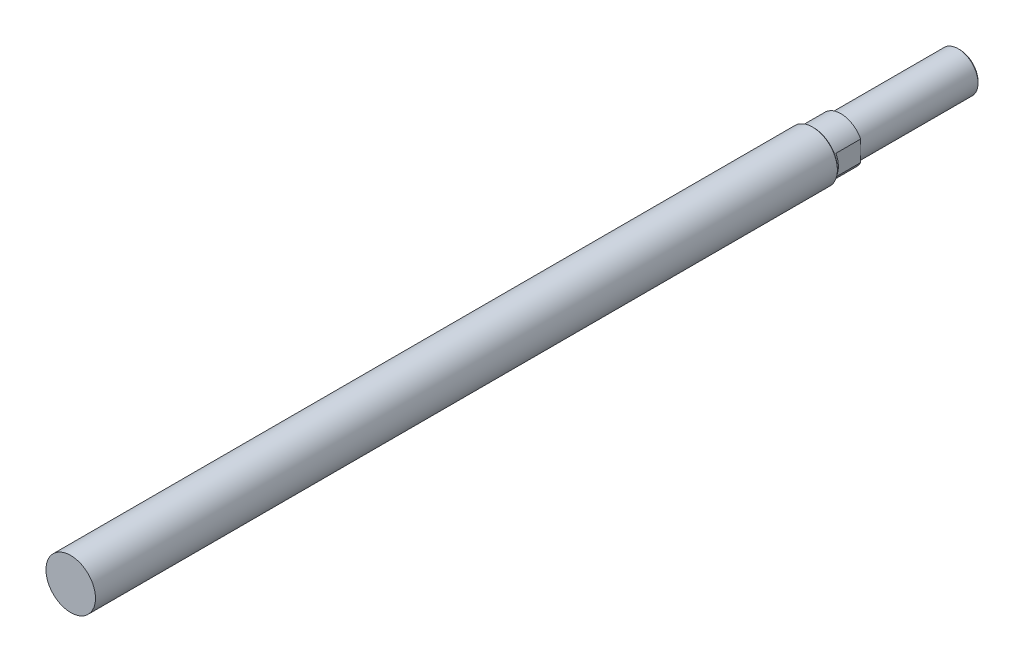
ISO-10303-21;
HEADER;
FILE_DESCRIPTION(('STEP AP214'),'2;1');
FILE_NAME('part.step','',(''),(''),'','','');
FILE_SCHEMA(('AUTOMOTIVE_DESIGN { 1 0 10303 214 1 1 1 1 }'));
ENDSEC;
DATA;
#1=APPLICATION_CONTEXT('core data for automotive mechanical design processes');
#2=APPLICATION_PROTOCOL_DEFINITION('international standard','automotive_design',2000,#1);
#3=PRODUCT_CONTEXT('',#1,'mechanical');
#4=PRODUCT('Part','Part','',(#3));
#5=PRODUCT_RELATED_PRODUCT_CATEGORY('part','',(#4));
#6=PRODUCT_DEFINITION_FORMATION('','',#4);
#7=PRODUCT_DEFINITION_CONTEXT('part definition',#1,'design');
#8=PRODUCT_DEFINITION('design','',#6,#7);
#9=PRODUCT_DEFINITION_SHAPE('','',#8);
#10=(LENGTH_UNIT() NAMED_UNIT(*) SI_UNIT(.MILLI.,.METRE.));
#11=(NAMED_UNIT(*) PLANE_ANGLE_UNIT() SI_UNIT($,.RADIAN.));
#12=(NAMED_UNIT(*) SI_UNIT($,.STERADIAN.) SOLID_ANGLE_UNIT());
#13=UNCERTAINTY_MEASURE_WITH_UNIT(LENGTH_MEASURE(1.E-05),#10,'distance_accuracy_value','');
#14=(GEOMETRIC_REPRESENTATION_CONTEXT(3) GLOBAL_UNCERTAINTY_ASSIGNED_CONTEXT((#13)) GLOBAL_UNIT_ASSIGNED_CONTEXT((#10,
#11,#12)) REPRESENTATION_CONTEXT('',''));
#15=CARTESIAN_POINT('',(0.,0.,0.));
#16=DIRECTION('',(0.,0.,1.));
#17=DIRECTION('',(1.,0.,0.));
#18=AXIS2_PLACEMENT_3D('',#15,#16,#17);
#19=CARTESIAN_POINT('',(0.,0.,-5.50000000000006));
#20=DIRECTION('',(0.,0.,-1.));
#21=DIRECTION('',(-1.,0.,0.));
#22=AXIS2_PLACEMENT_3D('',#19,#20,#21);
#23=PLANE('',#22);
#24=CARTESIAN_POINT('',(0.,0.,-5.50000000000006));
#25=DIRECTION('',(0.,0.,-1.));
#26=DIRECTION('',(-1.,0.,0.));
#27=AXIS2_PLACEMENT_3D('',#24,#25,#26);
#28=CIRCLE('',#27,4.);
#29=CARTESIAN_POINT('',(-4.,0.,-5.50000000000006));
#30=VERTEX_POINT('',#29);
#31=CARTESIAN_POINT('',(4.,0.,-5.50000000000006));
#32=VERTEX_POINT('',#31);
#33=EDGE_CURVE('E416',#30,#32,#28,.T.);
#34=ORIENTED_EDGE('',*,*,#33,.F.);
#35=DIRECTION('',(0.,-1.,0.));
#36=VECTOR('',#35,1.);
#37=CARTESIAN_POINT('',(-4.,2.06155281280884,-5.50000000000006));
#38=LINE('',#37,#36);
#39=CARTESIAN_POINT('',(-4.,2.06155281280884,-5.50000000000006));
#40=VERTEX_POINT('',#39);
#41=EDGE_CURVE('E397',#40,#30,#38,.T.);
#42=ORIENTED_EDGE('',*,*,#41,.F.);
#43=CARTESIAN_POINT('',(0.,0.,-5.50000000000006));
#44=DIRECTION('',(0.,0.,-1.));
#45=DIRECTION('',(-1.,0.,0.));
#46=AXIS2_PLACEMENT_3D('',#43,#44,#45);
#47=CIRCLE('',#46,4.5);
#48=CARTESIAN_POINT('',(4.,2.06155281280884,-5.50000000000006));
#49=VERTEX_POINT('',#48);
#50=EDGE_CURVE('E444',#40,#49,#47,.T.);
#51=ORIENTED_EDGE('',*,*,#50,.T.);
#52=DIRECTION('',(0.,1.,0.));
#53=VECTOR('',#52,1.);
#54=CARTESIAN_POINT('',(4.,2.06155281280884,-5.50000000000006));
#55=LINE('',#54,#53);
#56=EDGE_CURVE('E417',#32,#49,#55,.T.);
#57=ORIENTED_EDGE('',*,*,#56,.F.);
#58=EDGE_LOOP('',(#34,#42,#51,#57));
#59=FACE_BOUND('',#58,.T.);
#60=ADVANCED_FACE('F348',(#59),#23,.T.);
#61=CARTESIAN_POINT('',(0.,0.,0.));
#62=DIRECTION('',(0.,0.,1.));
#63=DIRECTION('',(1.,0.,0.));
#64=AXIS2_PLACEMENT_3D('',#61,#62,#63);
#65=PLANE('',#64);
#66=CARTESIAN_POINT('',(0.,0.,0.));
#67=DIRECTION('',(0.,0.,1.));
#68=DIRECTION('',(1.,0.,0.));
#69=AXIS2_PLACEMENT_3D('',#66,#67,#68);
#70=CIRCLE('',#69,4.8);
#71=CARTESIAN_POINT('',(4.8,0.,0.));
#72=VERTEX_POINT('',#71);
#73=EDGE_CURVE('E421',#72,#72,#70,.F.);
#74=ORIENTED_EDGE('',*,*,#73,.T.);
#75=EDGE_LOOP('',(#74));
#76=FACE_BOUND('',#75,.T.);
#77=CARTESIAN_POINT('',(0.,0.,0.));
#78=DIRECTION('',(0.,0.,1.));
#79=DIRECTION('',(1.,0.,0.));
#80=AXIS2_PLACEMENT_3D('',#77,#78,#79);
#81=CIRCLE('',#80,4.5);
#82=CARTESIAN_POINT('',(4.5,0.,0.));
#83=VERTEX_POINT('',#82);
#84=EDGE_CURVE('E449',#83,#83,#81,.F.);
#85=ORIENTED_EDGE('',*,*,#84,.F.);
#86=EDGE_LOOP('',(#85));
#87=FACE_BOUND('',#86,.T.);
#88=ADVANCED_FACE('F474',(#76,#87),#65,.F.);
#89=CARTESIAN_POINT('',(0.,0.,150.));
#90=DIRECTION('',(0.,0.,-1.));
#91=DIRECTION('',(-1.,0.,0.));
#92=AXIS2_PLACEMENT_3D('',#89,#90,#91);
#93=CYLINDRICAL_SURFACE('',#92,5.);
#94=CARTESIAN_POINT('',(0.,0.,0.199999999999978));
#95=DIRECTION('',(0.,0.,1.));
#96=DIRECTION('',(1.,0.,0.));
#97=AXIS2_PLACEMENT_3D('',#94,#95,#96);
#98=CIRCLE('',#97,5.);
#99=CARTESIAN_POINT('',(5.,0.,0.199999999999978));
#100=VERTEX_POINT('',#99);
#101=EDGE_CURVE('E424',#100,#100,#98,.T.);
#102=ORIENTED_EDGE('',*,*,#101,.T.);
#103=EDGE_LOOP('',(#102));
#104=FACE_BOUND('',#103,.T.);
#105=CARTESIAN_POINT('',(0.,0.,150.));
#106=DIRECTION('',(0.,0.,1.));
#107=DIRECTION('',(1.,0.,0.));
#108=AXIS2_PLACEMENT_3D('',#105,#106,#107);
#109=CIRCLE('',#108,5.);
#110=CARTESIAN_POINT('',(5.,0.,150.));
#111=VERTEX_POINT('',#110);
#112=EDGE_CURVE('E446',#111,#111,#109,.T.);
#113=ORIENTED_EDGE('',*,*,#112,.F.);
#114=EDGE_LOOP('',(#113));
#115=FACE_BOUND('',#114,.T.);
#116=ADVANCED_FACE('F350',(#104,#115),#93,.T.);
#117=CARTESIAN_POINT('',(0.,0.,150.));
#118=DIRECTION('',(0.,0.,1.));
#119=DIRECTION('',(1.,0.,0.));
#120=AXIS2_PLACEMENT_3D('',#117,#118,#119);
#121=PLANE('',#120);
#122=ORIENTED_EDGE('',*,*,#112,.T.);
#123=EDGE_LOOP('',(#122));
#124=FACE_BOUND('',#123,.T.);
#125=ADVANCED_FACE('F490',(#124),#121,.T.);
#126=CARTESIAN_POINT('',(0.,0.,-5.50000000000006));
#127=DIRECTION('',(0.,0.,1.));
#128=DIRECTION('',(1.,0.,0.));
#129=AXIS2_PLACEMENT_3D('',#126,#127,#128);
#130=CYLINDRICAL_SURFACE('',#129,4.5);
#131=CARTESIAN_POINT('',(4.,-2.06155281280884,-5.50000000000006));
#132=VERTEX_POINT('',#131);
#133=CARTESIAN_POINT('',(-4.,-2.06155281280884,-5.50000000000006));
#134=VERTEX_POINT('',#133);
#135=EDGE_CURVE('E412',#132,#134,#47,.T.);
#136=ORIENTED_EDGE('',*,*,#135,.F.);
#137=DIRECTION('',(0.,0.,-1.));
#138=VECTOR('',#137,1.);
#139=CARTESIAN_POINT('',(4.,-2.06155281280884,-0.499999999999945));
#140=LINE('',#139,#138);
#141=CARTESIAN_POINT('',(4.,-2.06155281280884,-0.499999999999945));
#142=VERTEX_POINT('',#141);
#143=EDGE_CURVE('E371',#142,#132,#140,.T.);
#144=ORIENTED_EDGE('',*,*,#143,.F.);
#145=CARTESIAN_POINT('',(0.,0.,-0.499999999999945));
#146=DIRECTION('',(0.,0.,-1.));
#147=DIRECTION('',(-1.,0.,0.));
#148=AXIS2_PLACEMENT_3D('',#145,#146,#147);
#149=CIRCLE('',#148,4.5);
#150=CARTESIAN_POINT('',(4.,2.06155281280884,-0.499999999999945));
#151=VERTEX_POINT('',#150);
#152=EDGE_CURVE('E429',#151,#142,#149,.T.);
#153=ORIENTED_EDGE('',*,*,#152,.F.);
#154=DIRECTION('',(0.,0.,-1.));
#155=VECTOR('',#154,1.);
#156=CARTESIAN_POINT('',(4.,2.06155281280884,-0.499999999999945));
#157=LINE('',#156,#155);
#158=EDGE_CURVE('E414',#151,#49,#157,.T.);
#159=ORIENTED_EDGE('',*,*,#158,.T.);
#160=ORIENTED_EDGE('',*,*,#50,.F.);
#161=DIRECTION('',(0.,0.,-1.));
#162=VECTOR('',#161,1.);
#163=CARTESIAN_POINT('',(-4.,2.06155281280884,-0.499999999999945));
#164=LINE('',#163,#162);
#165=CARTESIAN_POINT('',(-4.,2.06155281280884,-0.499999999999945));
#166=VERTEX_POINT('',#165);
#167=EDGE_CURVE('E403',#166,#40,#164,.T.);
#168=ORIENTED_EDGE('',*,*,#167,.F.);
#169=CARTESIAN_POINT('',(0.,0.,-0.499999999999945));
#170=DIRECTION('',(0.,0.,-1.));
#171=DIRECTION('',(-1.,0.,0.));
#172=AXIS2_PLACEMENT_3D('',#169,#170,#171);
#173=CIRCLE('',#172,4.5);
#174=CARTESIAN_POINT('',(-4.,-2.06155281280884,-0.499999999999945));
#175=VERTEX_POINT('',#174);
#176=EDGE_CURVE('E408',#175,#166,#173,.T.);
#177=ORIENTED_EDGE('',*,*,#176,.F.);
#178=DIRECTION('',(0.,0.,-1.));
#179=VECTOR('',#178,1.);
#180=CARTESIAN_POINT('',(-4.,-2.06155281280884,-0.499999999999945));
#181=LINE('',#180,#179);
#182=EDGE_CURVE('E441',#175,#134,#181,.T.);
#183=ORIENTED_EDGE('',*,*,#182,.T.);
#184=EDGE_LOOP('',(#136,#144,#153,#159,#160,#168,#177,#183));
#185=FACE_BOUND('',#184,.T.);
#186=ORIENTED_EDGE('',*,*,#84,.T.);
#187=EDGE_LOOP('',(#186));
#188=FACE_BOUND('',#187,.T.);
#189=ADVANCED_FACE('F484',(#185,#188),#130,.T.);
#190=EDGE_CURVE('E363',#32,#30,#28,.T.);
#191=ORIENTED_EDGE('',*,*,#190,.F.);
#192=EDGE_CURVE('E427',#132,#32,#55,.T.);
#193=ORIENTED_EDGE('',*,*,#192,.F.);
#194=ORIENTED_EDGE('',*,*,#135,.T.);
#195=EDGE_CURVE('E399',#30,#134,#38,.T.);
#196=ORIENTED_EDGE('',*,*,#195,.F.);
#197=EDGE_LOOP('',(#191,#193,#194,#196));
#198=FACE_BOUND('',#197,.T.);
#199=ADVANCED_FACE('F410',(#198),#23,.T.);
#200=CARTESIAN_POINT('',(-4.,2.06155281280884,-0.499999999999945));
#201=DIRECTION('',(1.,0.,0.));
#202=DIRECTION('',(0.,1.,0.));
#203=AXIS2_PLACEMENT_3D('',#200,#201,#202);
#204=PLANE('',#203);
#205=ORIENTED_EDGE('',*,*,#41,.T.);
#206=ORIENTED_EDGE('',*,*,#195,.T.);
#207=ORIENTED_EDGE('',*,*,#182,.F.);
#208=DIRECTION('',(0.,-1.,0.));
#209=VECTOR('',#208,1.);
#210=CARTESIAN_POINT('',(-4.,2.06155281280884,-0.499999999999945));
#211=LINE('',#210,#209);
#212=EDGE_CURVE('E438',#166,#175,#211,.T.);
#213=ORIENTED_EDGE('',*,*,#212,.F.);
#214=ORIENTED_EDGE('',*,*,#167,.T.);
#215=EDGE_LOOP('',(#205,#206,#207,#213,#214));
#216=FACE_BOUND('',#215,.T.);
#217=ADVANCED_FACE('F398',(#216),#204,.F.);
#218=CARTESIAN_POINT('',(0.,0.,-0.499999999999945));
#219=DIRECTION('',(0.,0.,-1.));
#220=DIRECTION('',(-1.,0.,0.));
#221=AXIS2_PLACEMENT_3D('',#218,#219,#220);
#222=PLANE('',#221);
#223=ORIENTED_EDGE('',*,*,#176,.T.);
#224=ORIENTED_EDGE('',*,*,#212,.T.);
#225=EDGE_LOOP('',(#223,#224));
#226=FACE_BOUND('',#225,.T.);
#227=ADVANCED_FACE('F489',(#226),#222,.T.);
#228=CARTESIAN_POINT('',(4.,2.06155281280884,-0.499999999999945));
#229=DIRECTION('',(-1.,0.,0.));
#230=DIRECTION('',(0.,0.,1.));
#231=AXIS2_PLACEMENT_3D('',#228,#229,#230);
#232=PLANE('',#231);
#233=ORIENTED_EDGE('',*,*,#192,.T.);
#234=ORIENTED_EDGE('',*,*,#56,.T.);
#235=ORIENTED_EDGE('',*,*,#158,.F.);
#236=DIRECTION('',(0.,1.,0.));
#237=VECTOR('',#236,1.);
#238=CARTESIAN_POINT('',(4.,2.06155281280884,-0.499999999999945));
#239=LINE('',#238,#237);
#240=EDGE_CURVE('E431',#142,#151,#239,.T.);
#241=ORIENTED_EDGE('',*,*,#240,.F.);
#242=ORIENTED_EDGE('',*,*,#143,.T.);
#243=EDGE_LOOP('',(#233,#234,#235,#241,#242));
#244=FACE_BOUND('',#243,.T.);
#245=ADVANCED_FACE('F470',(#244),#232,.F.);
#246=CARTESIAN_POINT('',(0.,0.,-0.499999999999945));
#247=DIRECTION('',(0.,0.,-1.));
#248=DIRECTION('',(-1.,0.,0.));
#249=AXIS2_PLACEMENT_3D('',#246,#247,#248);
#250=PLANE('',#249);
#251=ORIENTED_EDGE('',*,*,#152,.T.);
#252=ORIENTED_EDGE('',*,*,#240,.T.);
#253=EDGE_LOOP('',(#251,#252));
#254=FACE_BOUND('',#253,.T.);
#255=ADVANCED_FACE('F459',(#254),#250,.T.);
#256=CARTESIAN_POINT('',(0.,0.,0.199999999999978));
#257=DIRECTION('',(0.,0.,1.));
#258=DIRECTION('',(1.,0.,0.));
#259=AXIS2_PLACEMENT_3D('',#256,#257,#258);
#260=CONICAL_SURFACE('',#259,5.,0.785398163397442);
#261=ORIENTED_EDGE('',*,*,#73,.F.);
#262=EDGE_LOOP('',(#261));
#263=FACE_BOUND('',#262,.T.);
#264=ORIENTED_EDGE('',*,*,#101,.F.);
#265=EDGE_LOOP('',(#264));
#266=FACE_BOUND('',#265,.T.);
#267=ADVANCED_FACE('F457',(#263,#266),#260,.T.);
#268=CARTESIAN_POINT('',(0.,0.,-29.5000000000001));
#269=DIRECTION('',(0.,0.,1.));
#270=DIRECTION('',(1.,0.,0.));
#271=AXIS2_PLACEMENT_3D('',#268,#269,#270);
#272=CYLINDRICAL_SURFACE('',#271,4.);
#273=CARTESIAN_POINT('',(0.,0.,-29.1999999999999));
#274=DIRECTION('',(0.,0.,-1.));
#275=DIRECTION('',(-1.,0.,0.));
#276=AXIS2_PLACEMENT_3D('',#273,#274,#275);
#277=CIRCLE('',#276,4.);
#278=CARTESIAN_POINT('',(-4.,0.,-29.1999999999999));
#279=VERTEX_POINT('',#278);
#280=EDGE_CURVE('E11',#279,#279,#277,.F.);
#281=ORIENTED_EDGE('',*,*,#280,.T.);
#282=EDGE_LOOP('',(#281));
#283=FACE_BOUND('',#282,.T.);
#284=ORIENTED_EDGE('',*,*,#33,.T.);
#285=ORIENTED_EDGE('',*,*,#190,.T.);
#286=EDGE_LOOP('',(#284,#285));
#287=FACE_BOUND('',#286,.T.);
#288=ADVANCED_FACE('F420',(#283,#287),#272,.T.);
#289=CARTESIAN_POINT('',(0.,0.,-29.5000000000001));
#290=DIRECTION('',(0.,0.,-1.));
#291=DIRECTION('',(-1.,0.,0.));
#292=AXIS2_PLACEMENT_3D('',#289,#290,#291);
#293=PLANE('',#292);
#294=CARTESIAN_POINT('',(0.,0.,-29.5000000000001));
#295=DIRECTION('',(0.,0.,-1.));
#296=DIRECTION('',(-1.,0.,0.));
#297=AXIS2_PLACEMENT_3D('',#294,#295,#296);
#298=CIRCLE('',#297,3.7);
#299=CARTESIAN_POINT('',(-3.7,0.,-29.5000000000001));
#300=VERTEX_POINT('',#299);
#301=EDGE_CURVE('E356',#300,#300,#298,.T.);
#302=ORIENTED_EDGE('',*,*,#301,.T.);
#303=EDGE_LOOP('',(#302));
#304=FACE_BOUND('',#303,.T.);
#305=ADVANCED_FACE('F467',(#304),#293,.T.);
#306=CARTESIAN_POINT('',(0.,0.,-29.5000000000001));
#307=DIRECTION('',(0.,0.,1.));
#308=DIRECTION('',(1.,0.,0.));
#309=AXIS2_PLACEMENT_3D('',#306,#307,#308);
#310=CONICAL_SURFACE('',#309,3.7,0.785398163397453);
#311=ORIENTED_EDGE('',*,*,#280,.F.);
#312=EDGE_LOOP('',(#311));
#313=FACE_BOUND('',#312,.T.);
#314=ORIENTED_EDGE('',*,*,#301,.F.);
#315=EDGE_LOOP('',(#314));
#316=FACE_BOUND('',#315,.T.);
#317=ADVANCED_FACE('F528',(#313,#316),#310,.T.);
#318=CLOSED_SHELL('',(#60,#88,#116,#125,#189,#199,#217,#227,#245,#255,#267,#288,#305,#317));
#319=MANIFOLD_SOLID_BREP('B2',#318);
#320=ADVANCED_BREP_SHAPE_REPRESENTATION('',(#18,#319),#14);
#321=SHAPE_DEFINITION_REPRESENTATION(#9,#320);
ENDSEC;
END-ISO-10303-21;
